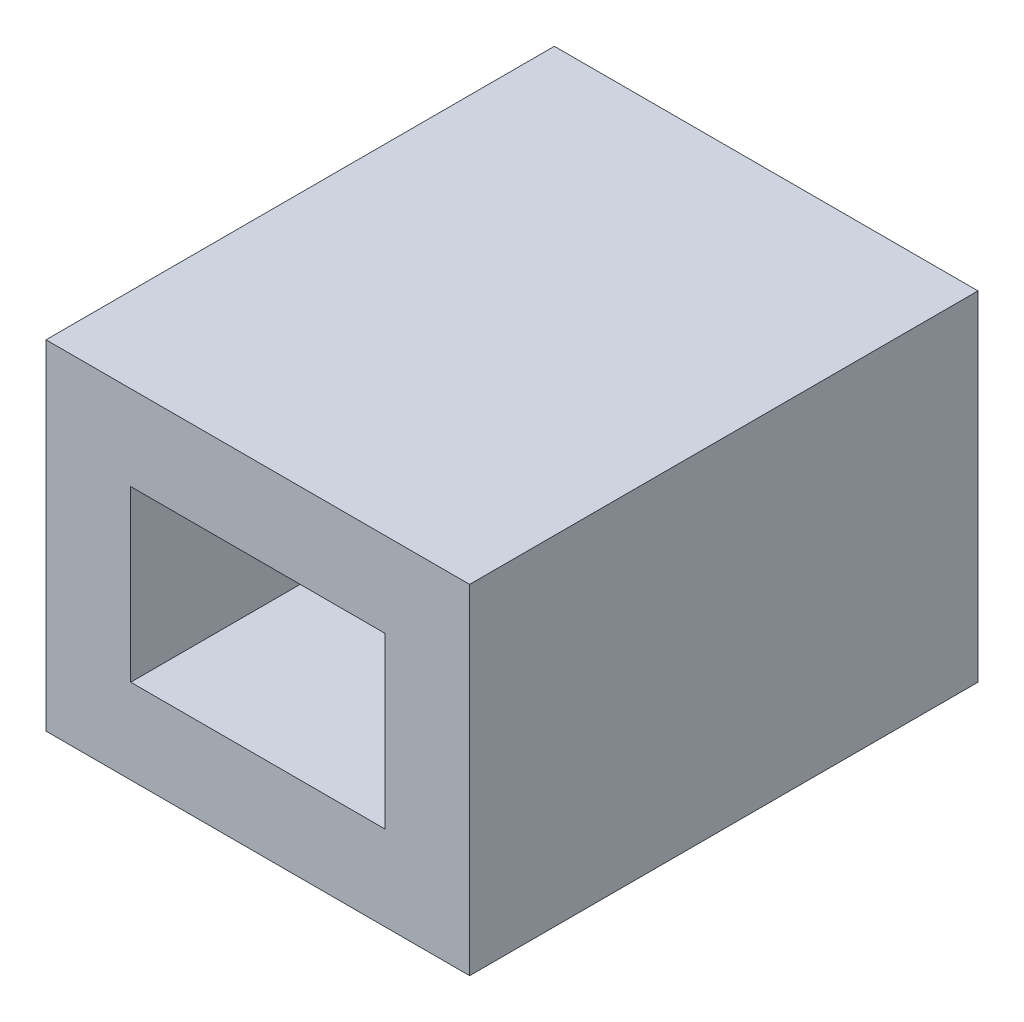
ISO-10303-21;
HEADER;
FILE_DESCRIPTION(('STEP AP214'),'2;1');
FILE_NAME('part.step','',(''),(''),'','','');
FILE_SCHEMA(('AUTOMOTIVE_DESIGN { 1 0 10303 214 1 1 1 1 }'));
ENDSEC;
DATA;
#1=APPLICATION_CONTEXT('core data for automotive mechanical design processes');
#2=APPLICATION_PROTOCOL_DEFINITION('international standard','automotive_design',2000,#1);
#3=PRODUCT_CONTEXT('',#1,'mechanical');
#4=PRODUCT('Part','Part','',(#3));
#5=PRODUCT_RELATED_PRODUCT_CATEGORY('part','',(#4));
#6=PRODUCT_DEFINITION_FORMATION('','',#4);
#7=PRODUCT_DEFINITION_CONTEXT('part definition',#1,'design');
#8=PRODUCT_DEFINITION('design','',#6,#7);
#9=PRODUCT_DEFINITION_SHAPE('','',#8);
#10=(LENGTH_UNIT() NAMED_UNIT(*) SI_UNIT(.MILLI.,.METRE.));
#11=(NAMED_UNIT(*) PLANE_ANGLE_UNIT() SI_UNIT($,.RADIAN.));
#12=(NAMED_UNIT(*) SI_UNIT($,.STERADIAN.) SOLID_ANGLE_UNIT());
#13=UNCERTAINTY_MEASURE_WITH_UNIT(LENGTH_MEASURE(1.E-05),#10,'distance_accuracy_value','');
#14=(GEOMETRIC_REPRESENTATION_CONTEXT(3) GLOBAL_UNCERTAINTY_ASSIGNED_CONTEXT((#13)) GLOBAL_UNIT_ASSIGNED_CONTEXT((#10,
#11,#12)) REPRESENTATION_CONTEXT('',''));
#15=CARTESIAN_POINT('',(0.,0.,0.));
#16=DIRECTION('',(0.,0.,1.));
#17=DIRECTION('',(1.,0.,0.));
#18=AXIS2_PLACEMENT_3D('',#15,#16,#17);
#19=CARTESIAN_POINT('',(-38.5269670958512,-34.4389842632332,76.2));
#20=DIRECTION('',(0.,0.,1.));
#21=DIRECTION('',(1.,0.,0.));
#22=AXIS2_PLACEMENT_3D('',#19,#20,#21);
#23=PLANE('',#22);
#24=DIRECTION('',(0.,-1.,0.));
#25=VECTOR('',#24,1.);
#26=CARTESIAN_POINT('',(-38.5269670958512,16.3610157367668,76.2));
#27=LINE('',#26,#25);
#28=CARTESIAN_POINT('',(-38.5269670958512,16.3610157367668,76.2));
#29=VERTEX_POINT('',#28);
#30=CARTESIAN_POINT('',(-38.5269670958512,-34.4389842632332,76.2));
#31=VERTEX_POINT('',#30);
#32=EDGE_CURVE('E140',#29,#31,#27,.T.);
#33=ORIENTED_EDGE('',*,*,#32,.T.);
#34=DIRECTION('',(1.,0.,0.));
#35=VECTOR('',#34,1.);
#36=CARTESIAN_POINT('',(-38.5269670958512,-34.4389842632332,76.2));
#37=LINE('',#36,#35);
#38=CARTESIAN_POINT('',(24.9730329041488,-34.4389842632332,76.2));
#39=VERTEX_POINT('',#38);
#40=EDGE_CURVE('E143',#31,#39,#37,.T.);
#41=ORIENTED_EDGE('',*,*,#40,.T.);
#42=DIRECTION('',(0.,1.,0.));
#43=VECTOR('',#42,1.);
#44=CARTESIAN_POINT('',(24.9730329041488,16.3610157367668,76.2));
#45=LINE('',#44,#43);
#46=CARTESIAN_POINT('',(24.9730329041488,16.3610157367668,76.2));
#47=VERTEX_POINT('',#46);
#48=EDGE_CURVE('E145',#39,#47,#45,.T.);
#49=ORIENTED_EDGE('',*,*,#48,.T.);
#50=DIRECTION('',(-1.,0.,0.));
#51=VECTOR('',#50,1.);
#52=CARTESIAN_POINT('',(-38.5269670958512,16.3610157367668,76.2));
#53=LINE('',#52,#51);
#54=EDGE_CURVE('E147',#47,#29,#53,.T.);
#55=ORIENTED_EDGE('',*,*,#54,.T.);
#56=EDGE_LOOP('',(#33,#41,#49,#55));
#57=FACE_BOUND('',#56,.T.);
#58=DIRECTION('',(1.,0.,0.));
#59=VECTOR('',#58,1.);
#60=CARTESIAN_POINT('',(-25.8269670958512,-21.7389842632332,76.2));
#61=LINE('',#60,#59);
#62=CARTESIAN_POINT('',(-25.8269670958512,-21.7389842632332,76.2));
#63=VERTEX_POINT('',#62);
#64=CARTESIAN_POINT('',(12.2730329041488,-21.7389842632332,76.2));
#65=VERTEX_POINT('',#64);
#66=EDGE_CURVE('E122',#63,#65,#61,.T.);
#67=ORIENTED_EDGE('',*,*,#66,.F.);
#68=DIRECTION('',(0.,-1.,0.));
#69=VECTOR('',#68,1.);
#70=CARTESIAN_POINT('',(-25.8269670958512,3.66101573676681,76.2));
#71=LINE('',#70,#69);
#72=CARTESIAN_POINT('',(-25.8269670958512,3.66101573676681,76.2));
#73=VERTEX_POINT('',#72);
#74=EDGE_CURVE('E111',#73,#63,#71,.T.);
#75=ORIENTED_EDGE('',*,*,#74,.F.);
#76=DIRECTION('',(-1.,0.,0.));
#77=VECTOR('',#76,1.);
#78=CARTESIAN_POINT('',(-25.8269670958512,3.66101573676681,76.2));
#79=LINE('',#78,#77);
#80=CARTESIAN_POINT('',(12.2730329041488,3.6610157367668,76.2));
#81=VERTEX_POINT('',#80);
#82=EDGE_CURVE('E126',#81,#73,#79,.T.);
#83=ORIENTED_EDGE('',*,*,#82,.F.);
#84=DIRECTION('',(0.,1.,0.));
#85=VECTOR('',#84,1.);
#86=CARTESIAN_POINT('',(12.2730329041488,3.66101573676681,76.2));
#87=LINE('',#86,#85);
#88=EDGE_CURVE('E124',#65,#81,#87,.T.);
#89=ORIENTED_EDGE('',*,*,#88,.F.);
#90=EDGE_LOOP('',(#67,#75,#83,#89));
#91=FACE_BOUND('',#90,.T.);
#92=ADVANCED_FACE('F31',(#57,#91),#23,.T.);
#93=CARTESIAN_POINT('',(-38.5269670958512,-34.4389842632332,0.));
#94=DIRECTION('',(0.,0.,1.));
#95=DIRECTION('',(1.,0.,0.));
#96=AXIS2_PLACEMENT_3D('',#93,#94,#95);
#97=PLANE('',#96);
#98=DIRECTION('',(0.,-1.,0.));
#99=VECTOR('',#98,1.);
#100=CARTESIAN_POINT('',(-38.5269670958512,16.3610157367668,0.));
#101=LINE('',#100,#99);
#102=CARTESIAN_POINT('',(-38.5269670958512,16.3610157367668,0.));
#103=VERTEX_POINT('',#102);
#104=CARTESIAN_POINT('',(-38.5269670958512,-34.4389842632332,0.));
#105=VERTEX_POINT('',#104);
#106=EDGE_CURVE('E112',#103,#105,#101,.T.);
#107=ORIENTED_EDGE('',*,*,#106,.F.);
#108=DIRECTION('',(-1.,0.,0.));
#109=VECTOR('',#108,1.);
#110=CARTESIAN_POINT('',(-38.5269670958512,16.3610157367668,0.));
#111=LINE('',#110,#109);
#112=CARTESIAN_POINT('',(24.9730329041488,16.3610157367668,0.));
#113=VERTEX_POINT('',#112);
#114=EDGE_CURVE('E138',#113,#103,#111,.T.);
#115=ORIENTED_EDGE('',*,*,#114,.F.);
#116=DIRECTION('',(0.,1.,0.));
#117=VECTOR('',#116,1.);
#118=CARTESIAN_POINT('',(24.9730329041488,16.3610157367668,0.));
#119=LINE('',#118,#117);
#120=CARTESIAN_POINT('',(24.9730329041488,-34.4389842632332,0.));
#121=VERTEX_POINT('',#120);
#122=EDGE_CURVE('E136',#121,#113,#119,.T.);
#123=ORIENTED_EDGE('',*,*,#122,.F.);
#124=DIRECTION('',(1.,0.,0.));
#125=VECTOR('',#124,1.);
#126=CARTESIAN_POINT('',(-38.5269670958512,-34.4389842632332,0.));
#127=LINE('',#126,#125);
#128=EDGE_CURVE('E134',#105,#121,#127,.T.);
#129=ORIENTED_EDGE('',*,*,#128,.F.);
#130=EDGE_LOOP('',(#107,#115,#123,#129));
#131=FACE_BOUND('',#130,.T.);
#132=DIRECTION('',(0.,-1.,0.));
#133=VECTOR('',#132,1.);
#134=CARTESIAN_POINT('',(-25.8269670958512,3.66101573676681,0.));
#135=LINE('',#134,#133);
#136=CARTESIAN_POINT('',(-25.8269670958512,3.6610157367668,0.));
#137=VERTEX_POINT('',#136);
#138=CARTESIAN_POINT('',(-25.8269670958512,-21.7389842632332,0.));
#139=VERTEX_POINT('',#138);
#140=EDGE_CURVE('E54',#137,#139,#135,.T.);
#141=ORIENTED_EDGE('',*,*,#140,.T.);
#142=DIRECTION('',(1.,0.,0.));
#143=VECTOR('',#142,1.);
#144=CARTESIAN_POINT('',(-25.8269670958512,-21.7389842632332,0.));
#145=LINE('',#144,#143);
#146=CARTESIAN_POINT('',(12.2730329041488,-21.7389842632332,0.));
#147=VERTEX_POINT('',#146);
#148=EDGE_CURVE('E98',#139,#147,#145,.T.);
#149=ORIENTED_EDGE('',*,*,#148,.T.);
#150=DIRECTION('',(0.,1.,0.));
#151=VECTOR('',#150,1.);
#152=CARTESIAN_POINT('',(12.2730329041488,3.66101573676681,0.));
#153=LINE('',#152,#151);
#154=CARTESIAN_POINT('',(12.2730329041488,3.66101573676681,0.));
#155=VERTEX_POINT('',#154);
#156=EDGE_CURVE('E107',#147,#155,#153,.T.);
#157=ORIENTED_EDGE('',*,*,#156,.T.);
#158=DIRECTION('',(-1.,0.,0.));
#159=VECTOR('',#158,1.);
#160=CARTESIAN_POINT('',(-25.8269670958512,3.66101573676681,0.));
#161=LINE('',#160,#159);
#162=EDGE_CURVE('E116',#155,#137,#161,.T.);
#163=ORIENTED_EDGE('',*,*,#162,.T.);
#164=EDGE_LOOP('',(#141,#149,#157,#163));
#165=FACE_BOUND('',#164,.T.);
#166=ADVANCED_FACE('F115',(#131,#165),#97,.F.);
#167=CARTESIAN_POINT('',(-38.5269670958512,16.3610157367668,76.2));
#168=DIRECTION('',(1.,0.,0.));
#169=DIRECTION('',(0.,1.,0.));
#170=AXIS2_PLACEMENT_3D('',#167,#168,#169);
#171=PLANE('',#170);
#172=ORIENTED_EDGE('',*,*,#106,.T.);
#173=DIRECTION('',(0.,0.,-1.));
#174=VECTOR('',#173,1.);
#175=CARTESIAN_POINT('',(-38.5269670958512,-34.4389842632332,76.2));
#176=LINE('',#175,#174);
#177=EDGE_CURVE('E11',#31,#105,#176,.T.);
#178=ORIENTED_EDGE('',*,*,#177,.F.);
#179=ORIENTED_EDGE('',*,*,#32,.F.);
#180=DIRECTION('',(0.,0.,-1.));
#181=VECTOR('',#180,1.);
#182=CARTESIAN_POINT('',(-38.5269670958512,16.3610157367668,76.2));
#183=LINE('',#182,#181);
#184=EDGE_CURVE('E149',#29,#103,#183,.T.);
#185=ORIENTED_EDGE('',*,*,#184,.T.);
#186=EDGE_LOOP('',(#172,#178,#179,#185));
#187=FACE_BOUND('',#186,.T.);
#188=ADVANCED_FACE('F33',(#187),#171,.F.);
#189=CARTESIAN_POINT('',(-38.5269670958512,-34.4389842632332,76.2));
#190=DIRECTION('',(0.,1.,0.));
#191=DIRECTION('',(0.,0.,1.));
#192=AXIS2_PLACEMENT_3D('',#189,#190,#191);
#193=PLANE('',#192);
#194=ORIENTED_EDGE('',*,*,#128,.T.);
#195=DIRECTION('',(0.,0.,-1.));
#196=VECTOR('',#195,1.);
#197=CARTESIAN_POINT('',(24.9730329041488,-34.4389842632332,76.2));
#198=LINE('',#197,#196);
#199=EDGE_CURVE('E39',#39,#121,#198,.T.);
#200=ORIENTED_EDGE('',*,*,#199,.F.);
#201=ORIENTED_EDGE('',*,*,#40,.F.);
#202=ORIENTED_EDGE('',*,*,#177,.T.);
#203=EDGE_LOOP('',(#194,#200,#201,#202));
#204=FACE_BOUND('',#203,.T.);
#205=ADVANCED_FACE('F174',(#204),#193,.F.);
#206=CARTESIAN_POINT('',(24.9730329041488,16.3610157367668,76.2));
#207=DIRECTION('',(-1.,0.,0.));
#208=DIRECTION('',(0.,0.,1.));
#209=AXIS2_PLACEMENT_3D('',#206,#207,#208);
#210=PLANE('',#209);
#211=ORIENTED_EDGE('',*,*,#122,.T.);
#212=DIRECTION('',(0.,0.,-1.));
#213=VECTOR('',#212,1.);
#214=CARTESIAN_POINT('',(24.9730329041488,16.3610157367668,76.2));
#215=LINE('',#214,#213);
#216=EDGE_CURVE('E152',#47,#113,#215,.T.);
#217=ORIENTED_EDGE('',*,*,#216,.F.);
#218=ORIENTED_EDGE('',*,*,#48,.F.);
#219=ORIENTED_EDGE('',*,*,#199,.T.);
#220=EDGE_LOOP('',(#211,#217,#218,#219));
#221=FACE_BOUND('',#220,.T.);
#222=ADVANCED_FACE('F159',(#221),#210,.F.);
#223=CARTESIAN_POINT('',(-38.5269670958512,16.3610157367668,76.2));
#224=DIRECTION('',(0.,-1.,0.));
#225=DIRECTION('',(0.,0.,-1.));
#226=AXIS2_PLACEMENT_3D('',#223,#224,#225);
#227=PLANE('',#226);
#228=ORIENTED_EDGE('',*,*,#114,.T.);
#229=ORIENTED_EDGE('',*,*,#184,.F.);
#230=ORIENTED_EDGE('',*,*,#54,.F.);
#231=ORIENTED_EDGE('',*,*,#216,.T.);
#232=EDGE_LOOP('',(#228,#229,#230,#231));
#233=FACE_BOUND('',#232,.T.);
#234=ADVANCED_FACE('F167',(#233),#227,.F.);
#235=CARTESIAN_POINT('',(-25.8269670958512,3.66101573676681,76.2));
#236=DIRECTION('',(1.,0.,0.));
#237=DIRECTION('',(0.,1.,0.));
#238=AXIS2_PLACEMENT_3D('',#235,#236,#237);
#239=PLANE('',#238);
#240=ORIENTED_EDGE('',*,*,#140,.F.);
#241=DIRECTION('',(0.,0.,-1.));
#242=VECTOR('',#241,1.);
#243=CARTESIAN_POINT('',(-25.8269670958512,3.66101573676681,76.2));
#244=LINE('',#243,#242);
#245=EDGE_CURVE('E128',#73,#137,#244,.T.);
#246=ORIENTED_EDGE('',*,*,#245,.F.);
#247=ORIENTED_EDGE('',*,*,#74,.T.);
#248=DIRECTION('',(0.,0.,-1.));
#249=VECTOR('',#248,1.);
#250=CARTESIAN_POINT('',(-25.8269670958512,-21.7389842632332,76.2));
#251=LINE('',#250,#249);
#252=EDGE_CURVE('E100',#63,#139,#251,.T.);
#253=ORIENTED_EDGE('',*,*,#252,.T.);
#254=EDGE_LOOP('',(#240,#246,#247,#253));
#255=FACE_BOUND('',#254,.T.);
#256=ADVANCED_FACE('F109',(#255),#239,.T.);
#257=CARTESIAN_POINT('',(-25.8269670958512,-21.7389842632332,76.2));
#258=DIRECTION('',(0.,1.,0.));
#259=DIRECTION('',(0.,0.,1.));
#260=AXIS2_PLACEMENT_3D('',#257,#258,#259);
#261=PLANE('',#260);
#262=ORIENTED_EDGE('',*,*,#148,.F.);
#263=ORIENTED_EDGE('',*,*,#252,.F.);
#264=ORIENTED_EDGE('',*,*,#66,.T.);
#265=DIRECTION('',(0.,0.,-1.));
#266=VECTOR('',#265,1.);
#267=CARTESIAN_POINT('',(12.2730329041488,-21.7389842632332,76.2));
#268=LINE('',#267,#266);
#269=EDGE_CURVE('E103',#65,#147,#268,.T.);
#270=ORIENTED_EDGE('',*,*,#269,.T.);
#271=EDGE_LOOP('',(#262,#263,#264,#270));
#272=FACE_BOUND('',#271,.T.);
#273=ADVANCED_FACE('F99',(#272),#261,.T.);
#274=CARTESIAN_POINT('',(12.2730329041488,3.66101573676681,76.2));
#275=DIRECTION('',(-1.,0.,0.));
#276=DIRECTION('',(0.,0.,1.));
#277=AXIS2_PLACEMENT_3D('',#274,#275,#276);
#278=PLANE('',#277);
#279=ORIENTED_EDGE('',*,*,#156,.F.);
#280=ORIENTED_EDGE('',*,*,#269,.F.);
#281=ORIENTED_EDGE('',*,*,#88,.T.);
#282=DIRECTION('',(0.,0.,-1.));
#283=VECTOR('',#282,1.);
#284=CARTESIAN_POINT('',(12.2730329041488,3.66101573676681,76.2));
#285=LINE('',#284,#283);
#286=EDGE_CURVE('E46',#81,#155,#285,.T.);
#287=ORIENTED_EDGE('',*,*,#286,.T.);
#288=EDGE_LOOP('',(#279,#280,#281,#287));
#289=FACE_BOUND('',#288,.T.);
#290=ADVANCED_FACE('F196',(#289),#278,.T.);
#291=CARTESIAN_POINT('',(-25.8269670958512,3.66101573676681,76.2));
#292=DIRECTION('',(0.,-1.,0.));
#293=DIRECTION('',(0.,0.,-1.));
#294=AXIS2_PLACEMENT_3D('',#291,#292,#293);
#295=PLANE('',#294);
#296=ORIENTED_EDGE('',*,*,#162,.F.);
#297=ORIENTED_EDGE('',*,*,#286,.F.);
#298=ORIENTED_EDGE('',*,*,#82,.T.);
#299=ORIENTED_EDGE('',*,*,#245,.T.);
#300=EDGE_LOOP('',(#296,#297,#298,#299));
#301=FACE_BOUND('',#300,.T.);
#302=ADVANCED_FACE('F201',(#301),#295,.T.);
#303=CLOSED_SHELL('',(#92,#166,#188,#205,#222,#234,#256,#273,#290,#302));
#304=MANIFOLD_SOLID_BREP('B2',#303);
#305=ADVANCED_BREP_SHAPE_REPRESENTATION('',(#18,#304),#14);
#306=SHAPE_DEFINITION_REPRESENTATION(#9,#305);
ENDSEC;
END-ISO-10303-21;
